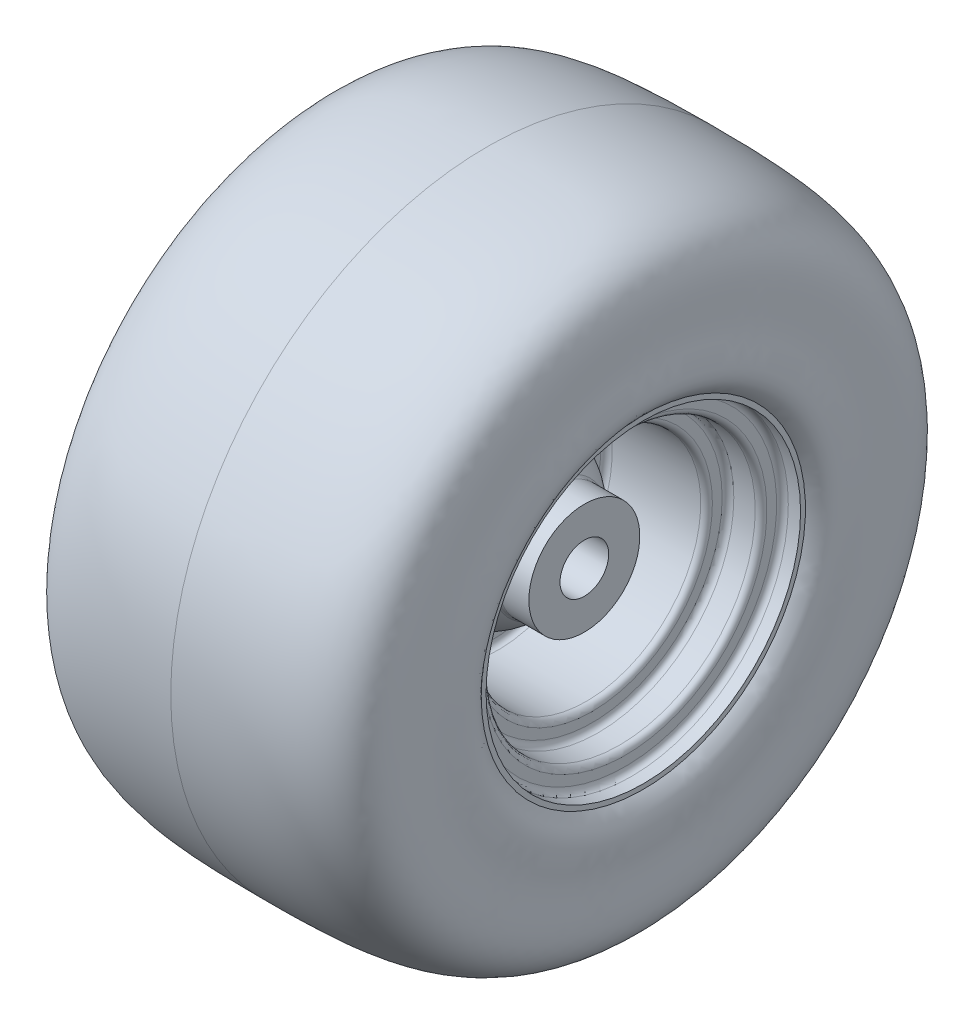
ISO-10303-21;
HEADER;
FILE_DESCRIPTION(('STEP AP214'),'2;1');
FILE_NAME('part.step','',(''),(''),'','','');
FILE_SCHEMA(('AUTOMOTIVE_DESIGN { 1 0 10303 214 1 1 1 1 }'));
ENDSEC;
DATA;
#1=APPLICATION_CONTEXT('core data for automotive mechanical design processes');
#2=APPLICATION_PROTOCOL_DEFINITION('international standard','automotive_design',2000,#1);
#3=PRODUCT_CONTEXT('',#1,'mechanical');
#4=PRODUCT('Part','Part','',(#3));
#5=PRODUCT_RELATED_PRODUCT_CATEGORY('part','',(#4));
#6=PRODUCT_DEFINITION_FORMATION('','',#4);
#7=PRODUCT_DEFINITION_CONTEXT('part definition',#1,'design');
#8=PRODUCT_DEFINITION('design','',#6,#7);
#9=PRODUCT_DEFINITION_SHAPE('','',#8);
#10=(LENGTH_UNIT() NAMED_UNIT(*) SI_UNIT(.MILLI.,.METRE.));
#11=(NAMED_UNIT(*) PLANE_ANGLE_UNIT() SI_UNIT($,.RADIAN.));
#12=(NAMED_UNIT(*) SI_UNIT($,.STERADIAN.) SOLID_ANGLE_UNIT());
#13=UNCERTAINTY_MEASURE_WITH_UNIT(LENGTH_MEASURE(1.E-05),#10,'distance_accuracy_value','');
#14=(GEOMETRIC_REPRESENTATION_CONTEXT(3) GLOBAL_UNCERTAINTY_ASSIGNED_CONTEXT((#13)) GLOBAL_UNIT_ASSIGNED_CONTEXT((#10,
#11,#12)) REPRESENTATION_CONTEXT('',''));
#15=CARTESIAN_POINT('',(0.,0.,0.));
#16=DIRECTION('',(0.,0.,1.));
#17=DIRECTION('',(1.,0.,0.));
#18=AXIS2_PLACEMENT_3D('',#15,#16,#17);
#19=CARTESIAN_POINT('',(-43.3521576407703,0.,0.));
#20=DIRECTION('',(-1.,0.,0.));
#21=DIRECTION('',(0.,0.,1.));
#22=AXIS2_PLACEMENT_3D('',#19,#20,#21);
#23=CYLINDRICAL_SURFACE('',#22,28.5);
#24=CARTESIAN_POINT('',(-50.,0.,0.));
#25=DIRECTION('',(-1.,0.,0.));
#26=DIRECTION('',(0.,0.,1.));
#27=AXIS2_PLACEMENT_3D('',#24,#25,#26);
#28=CIRCLE('',#27,28.5);
#29=CARTESIAN_POINT('',(-50.,0.,28.5));
#30=VERTEX_POINT('',#29);
#31=EDGE_CURVE('E10',#30,#30,#28,.T.);
#32=ORIENTED_EDGE('',*,*,#31,.F.);
#33=EDGE_LOOP('',(#32));
#34=FACE_BOUND('',#33,.T.);
#35=CARTESIAN_POINT('',(-34.3795027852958,0.,0.));
#36=DIRECTION('',(-1.,0.,0.));
#37=DIRECTION('',(0.,0.,1.));
#38=AXIS2_PLACEMENT_3D('',#35,#36,#37);
#39=CIRCLE('',#38,28.5);
#40=CARTESIAN_POINT('',(-34.3795027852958,0.,28.5));
#41=VERTEX_POINT('',#40);
#42=EDGE_CURVE('E144',#41,#41,#39,.T.);
#43=ORIENTED_EDGE('',*,*,#42,.T.);
#44=EDGE_LOOP('',(#43));
#45=FACE_BOUND('',#44,.T.);
#46=ADVANCED_FACE('F29',(#34,#45),#23,.T.);
#47=CARTESIAN_POINT('',(-50.,0.,-28.5));
#48=DIRECTION('',(1.,0.,0.));
#49=DIRECTION('',(0.,0.,-1.));
#50=AXIS2_PLACEMENT_3D('',#47,#48,#49);
#51=PLANE('',#50);
#52=CARTESIAN_POINT('',(-50.,0.,0.));
#53=DIRECTION('',(-1.,0.,0.));
#54=DIRECTION('',(0.,0.,1.));
#55=AXIS2_PLACEMENT_3D('',#52,#53,#54);
#56=CIRCLE('',#55,12.5);
#57=CARTESIAN_POINT('',(-50.,0.,12.5));
#58=VERTEX_POINT('',#57);
#59=EDGE_CURVE('E35',#58,#58,#56,.T.);
#60=ORIENTED_EDGE('',*,*,#59,.F.);
#61=EDGE_LOOP('',(#60));
#62=FACE_BOUND('',#61,.T.);
#63=ORIENTED_EDGE('',*,*,#31,.T.);
#64=EDGE_LOOP('',(#63));
#65=FACE_BOUND('',#64,.T.);
#66=ADVANCED_FACE('F239',(#62,#65),#51,.F.);
#67=CARTESIAN_POINT('',(-43.3521576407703,0.,0.));
#68=DIRECTION('',(-1.,0.,0.));
#69=DIRECTION('',(0.,0.,1.));
#70=AXIS2_PLACEMENT_3D('',#67,#68,#69);
#71=CYLINDRICAL_SURFACE('',#70,12.5);
#72=CARTESIAN_POINT('',(50.,0.,0.));
#73=DIRECTION('',(-1.,0.,0.));
#74=DIRECTION('',(0.,0.,1.));
#75=AXIS2_PLACEMENT_3D('',#72,#73,#74);
#76=CIRCLE('',#75,12.5);
#77=CARTESIAN_POINT('',(50.,0.,12.5));
#78=VERTEX_POINT('',#77);
#79=EDGE_CURVE('E39',#78,#78,#76,.T.);
#80=ORIENTED_EDGE('',*,*,#79,.F.);
#81=EDGE_LOOP('',(#80));
#82=FACE_BOUND('',#81,.T.);
#83=ORIENTED_EDGE('',*,*,#59,.T.);
#84=EDGE_LOOP('',(#83));
#85=FACE_BOUND('',#84,.T.);
#86=ADVANCED_FACE('F236',(#82,#85),#71,.F.);
#87=CARTESIAN_POINT('',(50.,0.,-28.5));
#88=DIRECTION('',(-1.,0.,0.));
#89=DIRECTION('',(0.,0.,1.));
#90=AXIS2_PLACEMENT_3D('',#87,#88,#89);
#91=PLANE('',#90);
#92=CARTESIAN_POINT('',(50.,0.,0.));
#93=DIRECTION('',(-1.,0.,0.));
#94=DIRECTION('',(0.,0.,1.));
#95=AXIS2_PLACEMENT_3D('',#92,#93,#94);
#96=CIRCLE('',#95,28.5);
#97=CARTESIAN_POINT('',(50.,0.,28.5));
#98=VERTEX_POINT('',#97);
#99=EDGE_CURVE('E43',#98,#98,#96,.T.);
#100=ORIENTED_EDGE('',*,*,#99,.F.);
#101=EDGE_LOOP('',(#100));
#102=FACE_BOUND('',#101,.T.);
#103=ORIENTED_EDGE('',*,*,#79,.T.);
#104=EDGE_LOOP('',(#103));
#105=FACE_BOUND('',#104,.T.);
#106=ADVANCED_FACE('F232',(#102,#105),#91,.F.);
#107=CARTESIAN_POINT('',(-43.3521576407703,0.,0.));
#108=DIRECTION('',(-1.,0.,0.));
#109=DIRECTION('',(0.,0.,1.));
#110=AXIS2_PLACEMENT_3D('',#107,#108,#109);
#111=CYLINDRICAL_SURFACE('',#110,28.5);
#112=CARTESIAN_POINT('',(34.3795027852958,0.,0.));
#113=DIRECTION('',(-1.,0.,0.));
#114=DIRECTION('',(0.,0.,1.));
#115=AXIS2_PLACEMENT_3D('',#112,#113,#114);
#116=CIRCLE('',#115,28.5);
#117=CARTESIAN_POINT('',(34.3795027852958,0.,28.5));
#118=VERTEX_POINT('',#117);
#119=EDGE_CURVE('E48',#118,#118,#116,.T.);
#120=ORIENTED_EDGE('',*,*,#119,.F.);
#121=EDGE_LOOP('',(#120));
#122=FACE_BOUND('',#121,.T.);
#123=ORIENTED_EDGE('',*,*,#99,.T.);
#124=EDGE_LOOP('',(#123));
#125=FACE_BOUND('',#124,.T.);
#126=ADVANCED_FACE('F228',(#122,#125),#111,.T.);
#127=CARTESIAN_POINT('',(34.3795027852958,0.,0.));
#128=DIRECTION('',(-1.,0.,0.));
#129=DIRECTION('',(0.,0.,1.));
#130=AXIS2_PLACEMENT_3D('',#127,#128,#129);
#131=TOROIDAL_SURFACE('',#130,31.5,3.00000000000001);
#132=CARTESIAN_POINT('',(32.2367100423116,0.,0.));
#133=DIRECTION('',(-1.,0.,0.));
#134=DIRECTION('',(0.,0.,1.));
#135=AXIS2_PLACEMENT_3D('',#132,#133,#134);
#136=CIRCLE('',#135,29.4003716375);
#137=CARTESIAN_POINT('',(32.2367100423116,0.,29.4003716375));
#138=VERTEX_POINT('',#137);
#139=EDGE_CURVE('E51',#138,#138,#136,.T.);
#140=ORIENTED_EDGE('',*,*,#139,.F.);
#141=EDGE_LOOP('',(#140));
#142=FACE_BOUND('',#141,.T.);
#143=ORIENTED_EDGE('',*,*,#119,.T.);
#144=EDGE_LOOP('',(#143));
#145=FACE_BOUND('',#144,.T.);
#146=ADVANCED_FACE('F224',(#142,#145),#131,.F.);
#147=CARTESIAN_POINT('',(-6.76211788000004,0.,0.));
#148=DIRECTION('',(-1.,0.,0.));
#149=DIRECTION('',(0.,0.,1.));
#150=AXIS2_PLACEMENT_3D('',#147,#148,#149);
#151=DEGENERATE_TOROIDAL_SURFACE('',#150,8.81286456,54.6,.F.);
#152=CARTESIAN_POINT('',(4.86134802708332,0.,0.));
#153=DIRECTION('',(-1.,0.,0.));
#154=DIRECTION('',(0.,0.,1.));
#155=AXIS2_PLACEMENT_3D('',#152,#153,#154);
#156=CIRCLE('',#155,44.5355659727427);
#157=CARTESIAN_POINT('',(4.86134802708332,0.,44.5355659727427));
#158=VERTEX_POINT('',#157);
#159=EDGE_CURVE('E54',#158,#158,#156,.T.);
#160=ORIENTED_EDGE('',*,*,#159,.F.);
#161=EDGE_LOOP('',(#160));
#162=FACE_BOUND('',#161,.T.);
#163=ORIENTED_EDGE('',*,*,#139,.T.);
#164=EDGE_LOOP('',(#163));
#165=FACE_BOUND('',#164,.T.);
#166=ADVANCED_FACE('F220',(#162,#165),#151,.F.);
#167=CARTESIAN_POINT('',(5.49999999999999,0.,0.));
#168=DIRECTION('',(-1.,0.,0.));
#169=DIRECTION('',(0.,0.,1.));
#170=AXIS2_PLACEMENT_3D('',#167,#168,#169);
#171=TOROIDAL_SURFACE('',#170,47.4667984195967,3.00000000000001);
#172=CARTESIAN_POINT('',(2.49999999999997,0.,0.));
#173=DIRECTION('',(-1.,0.,0.));
#174=DIRECTION('',(0.,0.,1.));
#175=AXIS2_PLACEMENT_3D('',#172,#173,#174);
#176=CIRCLE('',#175,47.4667984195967);
#177=CARTESIAN_POINT('',(2.49999999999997,0.,47.4667984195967));
#178=VERTEX_POINT('',#177);
#179=EDGE_CURVE('E57',#178,#178,#176,.T.);
#180=ORIENTED_EDGE('',*,*,#179,.F.);
#181=EDGE_LOOP('',(#180));
#182=FACE_BOUND('',#181,.T.);
#183=ORIENTED_EDGE('',*,*,#159,.T.);
#184=EDGE_LOOP('',(#183));
#185=FACE_BOUND('',#184,.T.);
#186=ADVANCED_FACE('F216',(#182,#185),#171,.F.);
#187=CARTESIAN_POINT('',(2.49999999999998,0.,-47.4667984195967));
#188=DIRECTION('',(-1.,0.,0.));
#189=DIRECTION('',(0.,0.,1.));
#190=AXIS2_PLACEMENT_3D('',#187,#188,#189);
#191=PLANE('',#190);
#192=CARTESIAN_POINT('',(2.49999999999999,0.,0.));
#193=DIRECTION('',(-1.,0.,0.));
#194=DIRECTION('',(0.,0.,1.));
#195=AXIS2_PLACEMENT_3D('',#192,#193,#194);
#196=CIRCLE('',#195,55.8);
#197=CARTESIAN_POINT('',(2.49999999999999,0.,55.8));
#198=VERTEX_POINT('',#197);
#199=EDGE_CURVE('E60',#198,#198,#196,.T.);
#200=ORIENTED_EDGE('',*,*,#199,.F.);
#201=EDGE_LOOP('',(#200));
#202=FACE_BOUND('',#201,.T.);
#203=ORIENTED_EDGE('',*,*,#179,.T.);
#204=EDGE_LOOP('',(#203));
#205=FACE_BOUND('',#204,.T.);
#206=ADVANCED_FACE('F212',(#202,#205),#191,.F.);
#207=CARTESIAN_POINT('',(5.49999999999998,0.,0.));
#208=DIRECTION('',(-1.,0.,0.));
#209=DIRECTION('',(0.,0.,1.));
#210=AXIS2_PLACEMENT_3D('',#207,#208,#209);
#211=TOROIDAL_SURFACE('',#210,55.8,3.);
#212=CARTESIAN_POINT('',(5.50000000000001,0.,0.));
#213=DIRECTION('',(-1.,0.,0.));
#214=DIRECTION('',(0.,0.,1.));
#215=AXIS2_PLACEMENT_3D('',#212,#213,#214);
#216=CIRCLE('',#215,58.8);
#217=CARTESIAN_POINT('',(5.50000000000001,0.,58.8));
#218=VERTEX_POINT('',#217);
#219=EDGE_CURVE('E63',#218,#218,#216,.T.);
#220=ORIENTED_EDGE('',*,*,#219,.F.);
#221=EDGE_LOOP('',(#220));
#222=FACE_BOUND('',#221,.T.);
#223=ORIENTED_EDGE('',*,*,#199,.T.);
#224=EDGE_LOOP('',(#223));
#225=FACE_BOUND('',#224,.T.);
#226=ADVANCED_FACE('F208',(#222,#225),#211,.F.);
#227=CARTESIAN_POINT('',(-43.3521576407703,0.,0.));
#228=DIRECTION('',(-1.,0.,0.));
#229=DIRECTION('',(0.,0.,1.));
#230=AXIS2_PLACEMENT_3D('',#227,#228,#229);
#231=CYLINDRICAL_SURFACE('',#230,58.8);
#232=CARTESIAN_POINT('',(51.,0.,0.));
#233=DIRECTION('',(-1.,0.,0.));
#234=DIRECTION('',(0.,0.,1.));
#235=AXIS2_PLACEMENT_3D('',#232,#233,#234);
#236=CIRCLE('',#235,58.8);
#237=CARTESIAN_POINT('',(51.,0.,58.8));
#238=VERTEX_POINT('',#237);
#239=EDGE_CURVE('E66',#238,#238,#236,.T.);
#240=ORIENTED_EDGE('',*,*,#239,.F.);
#241=EDGE_LOOP('',(#240));
#242=FACE_BOUND('',#241,.T.);
#243=ORIENTED_EDGE('',*,*,#219,.T.);
#244=EDGE_LOOP('',(#243));
#245=FACE_BOUND('',#244,.T.);
#246=ADVANCED_FACE('F204',(#242,#245),#231,.F.);
#247=CARTESIAN_POINT('',(51.,0.,0.));
#248=DIRECTION('',(-1.,0.,0.));
#249=DIRECTION('',(0.,0.,1.));
#250=AXIS2_PLACEMENT_3D('',#247,#248,#249);
#251=TOROIDAL_SURFACE('',#250,61.8,3.);
#252=CARTESIAN_POINT('',(54.,0.,0.));
#253=DIRECTION('',(-1.,0.,0.));
#254=DIRECTION('',(0.,0.,1.));
#255=AXIS2_PLACEMENT_3D('',#252,#253,#254);
#256=CIRCLE('',#255,61.8);
#257=CARTESIAN_POINT('',(54.,0.,61.8));
#258=VERTEX_POINT('',#257);
#259=EDGE_CURVE('E69',#258,#258,#256,.T.);
#260=ORIENTED_EDGE('',*,*,#259,.F.);
#261=EDGE_LOOP('',(#260));
#262=FACE_BOUND('',#261,.T.);
#263=ORIENTED_EDGE('',*,*,#239,.T.);
#264=EDGE_LOOP('',(#263));
#265=FACE_BOUND('',#264,.T.);
#266=ADVANCED_FACE('F200',(#262,#265),#251,.T.);
#267=CARTESIAN_POINT('',(54.,0.,-61.8));
#268=DIRECTION('',(-1.,0.,0.));
#269=DIRECTION('',(0.,0.,1.));
#270=AXIS2_PLACEMENT_3D('',#267,#268,#269);
#271=PLANE('',#270);
#272=CARTESIAN_POINT('',(54.,0.,0.));
#273=DIRECTION('',(-1.,0.,0.));
#274=DIRECTION('',(0.,0.,1.));
#275=AXIS2_PLACEMENT_3D('',#272,#273,#274);
#276=CIRCLE('',#275,66.8);
#277=CARTESIAN_POINT('',(54.,0.,66.8));
#278=VERTEX_POINT('',#277);
#279=EDGE_CURVE('E72',#278,#278,#276,.T.);
#280=ORIENTED_EDGE('',*,*,#279,.F.);
#281=EDGE_LOOP('',(#280));
#282=FACE_BOUND('',#281,.T.);
#283=ORIENTED_EDGE('',*,*,#259,.T.);
#284=EDGE_LOOP('',(#283));
#285=FACE_BOUND('',#284,.T.);
#286=ADVANCED_FACE('F196',(#282,#285),#271,.F.);
#287=CARTESIAN_POINT('',(57.,0.,0.));
#288=DIRECTION('',(-1.,0.,0.));
#289=DIRECTION('',(0.,0.,1.));
#290=AXIS2_PLACEMENT_3D('',#287,#288,#289);
#291=TOROIDAL_SURFACE('',#290,66.8,3.);
#292=CARTESIAN_POINT('',(57.,0.,0.));
#293=DIRECTION('',(-1.,0.,0.));
#294=DIRECTION('',(0.,0.,1.));
#295=AXIS2_PLACEMENT_3D('',#292,#293,#294);
#296=CIRCLE('',#295,69.8);
#297=CARTESIAN_POINT('',(57.,0.,69.8));
#298=VERTEX_POINT('',#297);
#299=EDGE_CURVE('E75',#298,#298,#296,.T.);
#300=ORIENTED_EDGE('',*,*,#299,.F.);
#301=EDGE_LOOP('',(#300));
#302=FACE_BOUND('',#301,.T.);
#303=ORIENTED_EDGE('',*,*,#279,.T.);
#304=EDGE_LOOP('',(#303));
#305=FACE_BOUND('',#304,.T.);
#306=ADVANCED_FACE('F192',(#302,#305),#291,.F.);
#307=CARTESIAN_POINT('',(-43.3521576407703,0.,0.));
#308=DIRECTION('',(-1.,0.,0.));
#309=DIRECTION('',(0.,0.,1.));
#310=AXIS2_PLACEMENT_3D('',#307,#308,#309);
#311=CYLINDRICAL_SURFACE('',#310,69.8);
#312=CARTESIAN_POINT('',(68.,0.,0.));
#313=DIRECTION('',(-1.,0.,0.));
#314=DIRECTION('',(0.,0.,1.));
#315=AXIS2_PLACEMENT_3D('',#312,#313,#314);
#316=CIRCLE('',#315,69.8);
#317=CARTESIAN_POINT('',(68.,0.,69.8));
#318=VERTEX_POINT('',#317);
#319=EDGE_CURVE('E78',#318,#318,#316,.T.);
#320=ORIENTED_EDGE('',*,*,#319,.F.);
#321=EDGE_LOOP('',(#320));
#322=FACE_BOUND('',#321,.T.);
#323=ORIENTED_EDGE('',*,*,#299,.T.);
#324=EDGE_LOOP('',(#323));
#325=FACE_BOUND('',#324,.T.);
#326=ADVANCED_FACE('F188',(#322,#325),#311,.F.);
#327=CARTESIAN_POINT('',(68.,0.,0.));
#328=DIRECTION('',(-1.,0.,0.));
#329=DIRECTION('',(0.,0.,1.));
#330=AXIS2_PLACEMENT_3D('',#327,#328,#329);
#331=TOROIDAL_SURFACE('',#330,72.8,3.);
#332=CARTESIAN_POINT('',(71.,0.,0.));
#333=DIRECTION('',(-1.,0.,0.));
#334=DIRECTION('',(0.,0.,1.));
#335=AXIS2_PLACEMENT_3D('',#332,#333,#334);
#336=CIRCLE('',#335,72.8);
#337=CARTESIAN_POINT('',(71.,0.,72.8));
#338=VERTEX_POINT('',#337);
#339=EDGE_CURVE('E81',#338,#338,#336,.T.);
#340=ORIENTED_EDGE('',*,*,#339,.F.);
#341=EDGE_LOOP('',(#340));
#342=FACE_BOUND('',#341,.T.);
#343=ORIENTED_EDGE('',*,*,#319,.T.);
#344=EDGE_LOOP('',(#343));
#345=FACE_BOUND('',#344,.T.);
#346=ADVANCED_FACE('F184',(#342,#345),#331,.T.);
#347=CARTESIAN_POINT('',(71.,0.,-72.8));
#348=DIRECTION('',(-1.,0.,0.));
#349=DIRECTION('',(0.,0.,1.));
#350=AXIS2_PLACEMENT_3D('',#347,#348,#349);
#351=PLANE('',#350);
#352=CARTESIAN_POINT('',(71.,0.,0.));
#353=DIRECTION('',(-1.,0.,0.));
#354=DIRECTION('',(0.,0.,1.));
#355=AXIS2_PLACEMENT_3D('',#352,#353,#354);
#356=CIRCLE('',#355,77.8);
#357=CARTESIAN_POINT('',(71.,0.,77.8));
#358=VERTEX_POINT('',#357);
#359=EDGE_CURVE('E84',#358,#358,#356,.T.);
#360=ORIENTED_EDGE('',*,*,#359,.F.);
#361=EDGE_LOOP('',(#360));
#362=FACE_BOUND('',#361,.T.);
#363=ORIENTED_EDGE('',*,*,#339,.T.);
#364=EDGE_LOOP('',(#363));
#365=FACE_BOUND('',#364,.T.);
#366=ADVANCED_FACE('F180',(#362,#365),#351,.F.);
#367=CARTESIAN_POINT('',(74.,0.,0.));
#368=DIRECTION('',(-1.,0.,0.));
#369=DIRECTION('',(0.,0.,1.));
#370=AXIS2_PLACEMENT_3D('',#367,#368,#369);
#371=TOROIDAL_SURFACE('',#370,77.8,3.);
#372=CARTESIAN_POINT('',(74.,0.,0.));
#373=DIRECTION('',(-1.,0.,0.));
#374=DIRECTION('',(0.,0.,1.));
#375=AXIS2_PLACEMENT_3D('',#372,#373,#374);
#376=CIRCLE('',#375,80.8);
#377=CARTESIAN_POINT('',(74.,0.,80.8));
#378=VERTEX_POINT('',#377);
#379=EDGE_CURVE('E87',#378,#378,#376,.T.);
#380=ORIENTED_EDGE('',*,*,#379,.F.);
#381=EDGE_LOOP('',(#380));
#382=FACE_BOUND('',#381,.T.);
#383=ORIENTED_EDGE('',*,*,#359,.T.);
#384=EDGE_LOOP('',(#383));
#385=FACE_BOUND('',#384,.T.);
#386=ADVANCED_FACE('F176',(#382,#385),#371,.F.);
#387=CARTESIAN_POINT('',(-43.3521576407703,0.,0.));
#388=DIRECTION('',(-1.,0.,0.));
#389=DIRECTION('',(0.,0.,1.));
#390=AXIS2_PLACEMENT_3D('',#387,#388,#389);
#391=CYLINDRICAL_SURFACE('',#390,80.8);
#392=CARTESIAN_POINT('',(80.3,0.,0.));
#393=DIRECTION('',(-1.,0.,0.));
#394=DIRECTION('',(0.,0.,1.));
#395=AXIS2_PLACEMENT_3D('',#392,#393,#394);
#396=CIRCLE('',#395,80.8);
#397=CARTESIAN_POINT('',(80.3,0.,80.8));
#398=VERTEX_POINT('',#397);
#399=EDGE_CURVE('E90',#398,#398,#396,.T.);
#400=ORIENTED_EDGE('',*,*,#399,.F.);
#401=EDGE_LOOP('',(#400));
#402=FACE_BOUND('',#401,.T.);
#403=ORIENTED_EDGE('',*,*,#379,.T.);
#404=EDGE_LOOP('',(#403));
#405=FACE_BOUND('',#404,.T.);
#406=ADVANCED_FACE('F172',(#402,#405),#391,.F.);
#407=CARTESIAN_POINT('',(80.3,0.,-80.8));
#408=DIRECTION('',(-1.,0.,0.));
#409=DIRECTION('',(0.,0.,1.));
#410=AXIS2_PLACEMENT_3D('',#407,#408,#409);
#411=PLANE('',#410);
#412=CARTESIAN_POINT('',(80.3,0.,0.));
#413=DIRECTION('',(-1.,0.,0.));
#414=DIRECTION('',(0.,0.,1.));
#415=AXIS2_PLACEMENT_3D('',#412,#413,#414);
#416=CIRCLE('',#415,83.3);
#417=CARTESIAN_POINT('',(80.3,0.,83.3));
#418=VERTEX_POINT('',#417);
#419=EDGE_CURVE('E93',#418,#418,#416,.T.);
#420=ORIENTED_EDGE('',*,*,#419,.F.);
#421=EDGE_LOOP('',(#420));
#422=FACE_BOUND('',#421,.T.);
#423=ORIENTED_EDGE('',*,*,#399,.T.);
#424=EDGE_LOOP('',(#423));
#425=FACE_BOUND('',#424,.T.);
#426=ADVANCED_FACE('F168',(#422,#425),#411,.F.);
#427=CARTESIAN_POINT('',(80.3,0.,-83.3));
#428=CARTESIAN_POINT('',(81.7916587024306,0.,-84.7461554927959));
#429=CARTESIAN_POINT('',(88.0411820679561,0.,-90.8050364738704));
#430=CARTESIAN_POINT('',(82.3574435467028,0.,-111.706032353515));
#431=CARTESIAN_POINT('',(90.9745394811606,0.,-162.134058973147));
#432=CARTESIAN_POINT('',(38.3567483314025,0.,-162.345711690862));
#433=CARTESIAN_POINT('',(0.,0.,-162.5));
#434=B_SPLINE_CURVE_WITH_KNOTS('',3,(#427,#428,#429,#430,#431,#432,#433),.UNSPECIFIED.,.F.,.F.,
(4,1,1,1,4),(0.,0.0418672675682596,0.175409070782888,0.398898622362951,1.),.UNSPECIFIED.);
#435=CARTESIAN_POINT('',(-43.3521576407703,0.,0.));
#436=DIRECTION('',(-1.,0.,0.));
#437=AXIS1_PLACEMENT('',#435,#436);
#438=SURFACE_OF_REVOLUTION('',#434,#437);
#439=CARTESIAN_POINT('',(0.,0.,0.));
#440=DIRECTION('',(-1.,0.,0.));
#441=DIRECTION('',(0.,0.,1.));
#442=AXIS2_PLACEMENT_3D('',#439,#440,#441);
#443=CIRCLE('',#442,162.5);
#444=CARTESIAN_POINT('',(0.,0.,162.5));
#445=VERTEX_POINT('',#444);
#446=EDGE_CURVE('E96',#445,#445,#443,.T.);
#447=ORIENTED_EDGE('',*,*,#446,.F.);
#448=EDGE_LOOP('',(#447));
#449=FACE_BOUND('',#448,.T.);
#450=ORIENTED_EDGE('',*,*,#419,.T.);
#451=EDGE_LOOP('',(#450));
#452=FACE_BOUND('',#451,.T.);
#453=ADVANCED_FACE('F163',(#449,#452),#438,.T.);
#454=CARTESIAN_POINT('',(0.,0.,-162.5));
#455=CARTESIAN_POINT('',(-38.3567483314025,0.,-162.345711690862));
#456=CARTESIAN_POINT('',(-90.9745394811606,0.,-162.134058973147));
#457=CARTESIAN_POINT('',(-82.3574435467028,0.,-111.706032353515));
#458=CARTESIAN_POINT('',(-88.041182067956,0.,-90.8050364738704));
#459=CARTESIAN_POINT('',(-81.7916587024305,0.,-84.7461554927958));
#460=CARTESIAN_POINT('',(-80.3,0.,-83.3));
#461=B_SPLINE_CURVE_WITH_KNOTS('',3,(#454,#455,#456,#457,#458,#459,#460),.UNSPECIFIED.,.F.,.F.,
(4,1,1,1,4),(0.,0.601101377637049,0.824590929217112,0.95813273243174,1.),.UNSPECIFIED.);
#462=CARTESIAN_POINT('',(-43.3521576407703,0.,0.));
#463=DIRECTION('',(-1.,0.,0.));
#464=AXIS1_PLACEMENT('',#462,#463);
#465=SURFACE_OF_REVOLUTION('',#461,#464);
#466=CARTESIAN_POINT('',(-80.3,0.,0.));
#467=DIRECTION('',(-1.,0.,0.));
#468=DIRECTION('',(0.,0.,1.));
#469=AXIS2_PLACEMENT_3D('',#466,#467,#468);
#470=CIRCLE('',#469,83.3);
#471=CARTESIAN_POINT('',(-80.3,0.,83.3));
#472=VERTEX_POINT('',#471);
#473=EDGE_CURVE('E99',#472,#472,#470,.T.);
#474=ORIENTED_EDGE('',*,*,#473,.F.);
#475=EDGE_LOOP('',(#474));
#476=FACE_BOUND('',#475,.T.);
#477=ORIENTED_EDGE('',*,*,#446,.T.);
#478=EDGE_LOOP('',(#477));
#479=FACE_BOUND('',#478,.T.);
#480=ADVANCED_FACE('F158',(#476,#479),#465,.T.);
#481=CARTESIAN_POINT('',(-80.3,0.,-80.8));
#482=DIRECTION('',(1.,0.,0.));
#483=DIRECTION('',(0.,0.,-1.));
#484=AXIS2_PLACEMENT_3D('',#481,#482,#483);
#485=PLANE('',#484);
#486=CARTESIAN_POINT('',(-80.3,0.,0.));
#487=DIRECTION('',(-1.,0.,0.));
#488=DIRECTION('',(0.,0.,1.));
#489=AXIS2_PLACEMENT_3D('',#486,#487,#488);
#490=CIRCLE('',#489,80.8);
#491=CARTESIAN_POINT('',(-80.3,0.,80.8));
#492=VERTEX_POINT('',#491);
#493=EDGE_CURVE('E102',#492,#492,#490,.T.);
#494=ORIENTED_EDGE('',*,*,#493,.F.);
#495=EDGE_LOOP('',(#494));
#496=FACE_BOUND('',#495,.T.);
#497=ORIENTED_EDGE('',*,*,#473,.T.);
#498=EDGE_LOOP('',(#497));
#499=FACE_BOUND('',#498,.T.);
#500=ADVANCED_FACE('F162',(#496,#499),#485,.F.);
#501=CARTESIAN_POINT('',(-43.3521576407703,0.,0.));
#502=DIRECTION('',(-1.,0.,0.));
#503=DIRECTION('',(0.,0.,1.));
#504=AXIS2_PLACEMENT_3D('',#501,#502,#503);
#505=CYLINDRICAL_SURFACE('',#504,80.8);
#506=CARTESIAN_POINT('',(-74.,0.,0.));
#507=DIRECTION('',(-1.,0.,0.));
#508=DIRECTION('',(0.,0.,1.));
#509=AXIS2_PLACEMENT_3D('',#506,#507,#508);
#510=CIRCLE('',#509,80.8);
#511=CARTESIAN_POINT('',(-74.,0.,80.8));
#512=VERTEX_POINT('',#511);
#513=EDGE_CURVE('E105',#512,#512,#510,.T.);
#514=ORIENTED_EDGE('',*,*,#513,.F.);
#515=EDGE_LOOP('',(#514));
#516=FACE_BOUND('',#515,.T.);
#517=ORIENTED_EDGE('',*,*,#493,.T.);
#518=EDGE_LOOP('',(#517));
#519=FACE_BOUND('',#518,.T.);
#520=ADVANCED_FACE('F327',(#516,#519),#505,.F.);
#521=CARTESIAN_POINT('',(-74.,0.,0.));
#522=DIRECTION('',(-1.,0.,0.));
#523=DIRECTION('',(0.,0.,1.));
#524=AXIS2_PLACEMENT_3D('',#521,#522,#523);
#525=TOROIDAL_SURFACE('',#524,77.8,3.);
#526=CARTESIAN_POINT('',(-71.,0.,0.));
#527=DIRECTION('',(-1.,0.,0.));
#528=DIRECTION('',(0.,0.,1.));
#529=AXIS2_PLACEMENT_3D('',#526,#527,#528);
#530=CIRCLE('',#529,77.8);
#531=CARTESIAN_POINT('',(-71.,0.,77.8));
#532=VERTEX_POINT('',#531);
#533=EDGE_CURVE('E108',#532,#532,#530,.T.);
#534=ORIENTED_EDGE('',*,*,#533,.F.);
#535=EDGE_LOOP('',(#534));
#536=FACE_BOUND('',#535,.T.);
#537=ORIENTED_EDGE('',*,*,#513,.T.);
#538=EDGE_LOOP('',(#537));
#539=FACE_BOUND('',#538,.T.);
#540=ADVANCED_FACE('F321',(#536,#539),#525,.F.);
#541=CARTESIAN_POINT('',(-71.,0.,-72.8));
#542=DIRECTION('',(1.,0.,0.));
#543=DIRECTION('',(0.,0.,-1.));
#544=AXIS2_PLACEMENT_3D('',#541,#542,#543);
#545=PLANE('',#544);
#546=CARTESIAN_POINT('',(-71.,0.,0.));
#547=DIRECTION('',(-1.,0.,0.));
#548=DIRECTION('',(0.,0.,1.));
#549=AXIS2_PLACEMENT_3D('',#546,#547,#548);
#550=CIRCLE('',#549,72.8);
#551=CARTESIAN_POINT('',(-71.,0.,72.8));
#552=VERTEX_POINT('',#551);
#553=EDGE_CURVE('E111',#552,#552,#550,.T.);
#554=ORIENTED_EDGE('',*,*,#553,.F.);
#555=EDGE_LOOP('',(#554));
#556=FACE_BOUND('',#555,.T.);
#557=ORIENTED_EDGE('',*,*,#533,.T.);
#558=EDGE_LOOP('',(#557));
#559=FACE_BOUND('',#558,.T.);
#560=ADVANCED_FACE('F315',(#556,#559),#545,.F.);
#561=CARTESIAN_POINT('',(-68.,0.,0.));
#562=DIRECTION('',(-1.,0.,0.));
#563=DIRECTION('',(0.,0.,1.));
#564=AXIS2_PLACEMENT_3D('',#561,#562,#563);
#565=TOROIDAL_SURFACE('',#564,72.8,3.);
#566=CARTESIAN_POINT('',(-68.,0.,0.));
#567=DIRECTION('',(-1.,0.,0.));
#568=DIRECTION('',(0.,0.,1.));
#569=AXIS2_PLACEMENT_3D('',#566,#567,#568);
#570=CIRCLE('',#569,69.8);
#571=CARTESIAN_POINT('',(-68.,0.,69.8));
#572=VERTEX_POINT('',#571);
#573=EDGE_CURVE('E114',#572,#572,#570,.T.);
#574=ORIENTED_EDGE('',*,*,#573,.F.);
#575=EDGE_LOOP('',(#574));
#576=FACE_BOUND('',#575,.T.);
#577=ORIENTED_EDGE('',*,*,#553,.T.);
#578=EDGE_LOOP('',(#577));
#579=FACE_BOUND('',#578,.T.);
#580=ADVANCED_FACE('F309',(#576,#579),#565,.T.);
#581=CARTESIAN_POINT('',(-43.3521576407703,0.,0.));
#582=DIRECTION('',(-1.,0.,0.));
#583=DIRECTION('',(0.,0.,1.));
#584=AXIS2_PLACEMENT_3D('',#581,#582,#583);
#585=CYLINDRICAL_SURFACE('',#584,69.8);
#586=CARTESIAN_POINT('',(-57.,0.,0.));
#587=DIRECTION('',(-1.,0.,0.));
#588=DIRECTION('',(0.,0.,1.));
#589=AXIS2_PLACEMENT_3D('',#586,#587,#588);
#590=CIRCLE('',#589,69.8);
#591=CARTESIAN_POINT('',(-57.,0.,69.8));
#592=VERTEX_POINT('',#591);
#593=EDGE_CURVE('E117',#592,#592,#590,.T.);
#594=ORIENTED_EDGE('',*,*,#593,.F.);
#595=EDGE_LOOP('',(#594));
#596=FACE_BOUND('',#595,.T.);
#597=ORIENTED_EDGE('',*,*,#573,.T.);
#598=EDGE_LOOP('',(#597));
#599=FACE_BOUND('',#598,.T.);
#600=ADVANCED_FACE('F303',(#596,#599),#585,.F.);
#601=CARTESIAN_POINT('',(-57.,0.,0.));
#602=DIRECTION('',(-1.,0.,0.));
#603=DIRECTION('',(0.,0.,1.));
#604=AXIS2_PLACEMENT_3D('',#601,#602,#603);
#605=TOROIDAL_SURFACE('',#604,66.8,3.);
#606=CARTESIAN_POINT('',(-54.,0.,0.));
#607=DIRECTION('',(-1.,0.,0.));
#608=DIRECTION('',(0.,0.,1.));
#609=AXIS2_PLACEMENT_3D('',#606,#607,#608);
#610=CIRCLE('',#609,66.8);
#611=CARTESIAN_POINT('',(-54.,0.,66.8));
#612=VERTEX_POINT('',#611);
#613=EDGE_CURVE('E120',#612,#612,#610,.T.);
#614=ORIENTED_EDGE('',*,*,#613,.F.);
#615=EDGE_LOOP('',(#614));
#616=FACE_BOUND('',#615,.T.);
#617=ORIENTED_EDGE('',*,*,#593,.T.);
#618=EDGE_LOOP('',(#617));
#619=FACE_BOUND('',#618,.T.);
#620=ADVANCED_FACE('F297',(#616,#619),#605,.F.);
#621=CARTESIAN_POINT('',(-54.,0.,-61.8));
#622=DIRECTION('',(1.,0.,0.));
#623=DIRECTION('',(0.,0.,-1.));
#624=AXIS2_PLACEMENT_3D('',#621,#622,#623);
#625=PLANE('',#624);
#626=CARTESIAN_POINT('',(-54.,0.,0.));
#627=DIRECTION('',(-1.,0.,0.));
#628=DIRECTION('',(0.,0.,1.));
#629=AXIS2_PLACEMENT_3D('',#626,#627,#628);
#630=CIRCLE('',#629,61.8);
#631=CARTESIAN_POINT('',(-54.,0.,61.8));
#632=VERTEX_POINT('',#631);
#633=EDGE_CURVE('E123',#632,#632,#630,.T.);
#634=ORIENTED_EDGE('',*,*,#633,.F.);
#635=EDGE_LOOP('',(#634));
#636=FACE_BOUND('',#635,.T.);
#637=ORIENTED_EDGE('',*,*,#613,.T.);
#638=EDGE_LOOP('',(#637));
#639=FACE_BOUND('',#638,.T.);
#640=ADVANCED_FACE('F291',(#636,#639),#625,.F.);
#641=CARTESIAN_POINT('',(-51.,0.,0.));
#642=DIRECTION('',(-1.,0.,0.));
#643=DIRECTION('',(0.,0.,1.));
#644=AXIS2_PLACEMENT_3D('',#641,#642,#643);
#645=TOROIDAL_SURFACE('',#644,61.8,3.);
#646=CARTESIAN_POINT('',(-51.,0.,0.));
#647=DIRECTION('',(-1.,0.,0.));
#648=DIRECTION('',(0.,0.,1.));
#649=AXIS2_PLACEMENT_3D('',#646,#647,#648);
#650=CIRCLE('',#649,58.8);
#651=CARTESIAN_POINT('',(-51.,0.,58.8));
#652=VERTEX_POINT('',#651);
#653=EDGE_CURVE('E126',#652,#652,#650,.T.);
#654=ORIENTED_EDGE('',*,*,#653,.F.);
#655=EDGE_LOOP('',(#654));
#656=FACE_BOUND('',#655,.T.);
#657=ORIENTED_EDGE('',*,*,#633,.T.);
#658=EDGE_LOOP('',(#657));
#659=FACE_BOUND('',#658,.T.);
#660=ADVANCED_FACE('F285',(#656,#659),#645,.T.);
#661=CARTESIAN_POINT('',(-43.3521576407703,0.,0.));
#662=DIRECTION('',(-1.,0.,0.));
#663=DIRECTION('',(0.,0.,1.));
#664=AXIS2_PLACEMENT_3D('',#661,#662,#663);
#665=CYLINDRICAL_SURFACE('',#664,58.8);
#666=CARTESIAN_POINT('',(-5.50000000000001,0.,0.));
#667=DIRECTION('',(-1.,0.,0.));
#668=DIRECTION('',(0.,0.,1.));
#669=AXIS2_PLACEMENT_3D('',#666,#667,#668);
#670=CIRCLE('',#669,58.8);
#671=CARTESIAN_POINT('',(-5.50000000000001,0.,58.8));
#672=VERTEX_POINT('',#671);
#673=EDGE_CURVE('E129',#672,#672,#670,.T.);
#674=ORIENTED_EDGE('',*,*,#673,.F.);
#675=EDGE_LOOP('',(#674));
#676=FACE_BOUND('',#675,.T.);
#677=ORIENTED_EDGE('',*,*,#653,.T.);
#678=EDGE_LOOP('',(#677));
#679=FACE_BOUND('',#678,.T.);
#680=ADVANCED_FACE('F279',(#676,#679),#665,.F.);
#681=CARTESIAN_POINT('',(-5.49999999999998,0.,0.));
#682=DIRECTION('',(-1.,0.,0.));
#683=DIRECTION('',(0.,0.,1.));
#684=AXIS2_PLACEMENT_3D('',#681,#682,#683);
#685=TOROIDAL_SURFACE('',#684,55.8,3.);
#686=CARTESIAN_POINT('',(-2.49999999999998,0.,0.));
#687=DIRECTION('',(-1.,0.,0.));
#688=DIRECTION('',(0.,0.,1.));
#689=AXIS2_PLACEMENT_3D('',#686,#687,#688);
#690=CIRCLE('',#689,55.8);
#691=CARTESIAN_POINT('',(-2.49999999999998,0.,55.8));
#692=VERTEX_POINT('',#691);
#693=EDGE_CURVE('E132',#692,#692,#690,.T.);
#694=ORIENTED_EDGE('',*,*,#693,.F.);
#695=EDGE_LOOP('',(#694));
#696=FACE_BOUND('',#695,.T.);
#697=ORIENTED_EDGE('',*,*,#673,.T.);
#698=EDGE_LOOP('',(#697));
#699=FACE_BOUND('',#698,.T.);
#700=ADVANCED_FACE('F273',(#696,#699),#685,.F.);
#701=CARTESIAN_POINT('',(-2.49999999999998,0.,-47.4667984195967));
#702=DIRECTION('',(1.,0.,0.));
#703=DIRECTION('',(0.,0.,-1.));
#704=AXIS2_PLACEMENT_3D('',#701,#702,#703);
#705=PLANE('',#704);
#706=CARTESIAN_POINT('',(-2.49999999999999,0.,0.));
#707=DIRECTION('',(-1.,0.,0.));
#708=DIRECTION('',(0.,0.,1.));
#709=AXIS2_PLACEMENT_3D('',#706,#707,#708);
#710=CIRCLE('',#709,47.4667984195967);
#711=CARTESIAN_POINT('',(-2.49999999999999,0.,47.4667984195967));
#712=VERTEX_POINT('',#711);
#713=EDGE_CURVE('E135',#712,#712,#710,.T.);
#714=ORIENTED_EDGE('',*,*,#713,.F.);
#715=EDGE_LOOP('',(#714));
#716=FACE_BOUND('',#715,.T.);
#717=ORIENTED_EDGE('',*,*,#693,.T.);
#718=EDGE_LOOP('',(#717));
#719=FACE_BOUND('',#718,.T.);
#720=ADVANCED_FACE('F267',(#716,#719),#705,.F.);
#721=CARTESIAN_POINT('',(-5.49999999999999,0.,0.));
#722=DIRECTION('',(-1.,0.,0.));
#723=DIRECTION('',(0.,0.,1.));
#724=AXIS2_PLACEMENT_3D('',#721,#722,#723);
#725=TOROIDAL_SURFACE('',#724,47.4667984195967,3.00000000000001);
#726=CARTESIAN_POINT('',(-4.86134802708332,0.,0.));
#727=DIRECTION('',(-1.,0.,0.));
#728=DIRECTION('',(0.,0.,1.));
#729=AXIS2_PLACEMENT_3D('',#726,#727,#728);
#730=CIRCLE('',#729,44.5355659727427);
#731=CARTESIAN_POINT('',(-4.86134802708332,0.,44.5355659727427));
#732=VERTEX_POINT('',#731);
#733=EDGE_CURVE('E138',#732,#732,#730,.T.);
#734=ORIENTED_EDGE('',*,*,#733,.F.);
#735=EDGE_LOOP('',(#734));
#736=FACE_BOUND('',#735,.T.);
#737=ORIENTED_EDGE('',*,*,#713,.T.);
#738=EDGE_LOOP('',(#737));
#739=FACE_BOUND('',#738,.T.);
#740=ADVANCED_FACE('F261',(#736,#739),#725,.F.);
#741=CARTESIAN_POINT('',(6.76211788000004,0.,0.));
#742=DIRECTION('',(-1.,0.,0.));
#743=DIRECTION('',(0.,0.,1.));
#744=AXIS2_PLACEMENT_3D('',#741,#742,#743);
#745=DEGENERATE_TOROIDAL_SURFACE('',#744,8.81286456,54.6,.F.);
#746=CARTESIAN_POINT('',(-32.2367100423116,0.,0.));
#747=DIRECTION('',(-1.,0.,0.));
#748=DIRECTION('',(0.,0.,1.));
#749=AXIS2_PLACEMENT_3D('',#746,#747,#748);
#750=CIRCLE('',#749,29.4003716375);
#751=CARTESIAN_POINT('',(-32.2367100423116,0.,29.4003716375));
#752=VERTEX_POINT('',#751);
#753=EDGE_CURVE('E141',#752,#752,#750,.T.);
#754=ORIENTED_EDGE('',*,*,#753,.F.);
#755=EDGE_LOOP('',(#754));
#756=FACE_BOUND('',#755,.T.);
#757=ORIENTED_EDGE('',*,*,#733,.T.);
#758=EDGE_LOOP('',(#757));
#759=FACE_BOUND('',#758,.T.);
#760=ADVANCED_FACE('F255',(#756,#759),#745,.F.);
#761=CARTESIAN_POINT('',(-34.3795027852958,0.,0.));
#762=DIRECTION('',(-1.,0.,0.));
#763=DIRECTION('',(0.,0.,1.));
#764=AXIS2_PLACEMENT_3D('',#761,#762,#763);
#765=TOROIDAL_SURFACE('',#764,31.5,3.00000000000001);
#766=ORIENTED_EDGE('',*,*,#42,.F.);
#767=EDGE_LOOP('',(#766));
#768=FACE_BOUND('',#767,.T.);
#769=ORIENTED_EDGE('',*,*,#753,.T.);
#770=EDGE_LOOP('',(#769));
#771=FACE_BOUND('',#770,.T.);
#772=ADVANCED_FACE('F252',(#768,#771),#765,.F.);
#773=CLOSED_SHELL('',(#46,#66,#86,#106,#126,#146,#166,#186,#206,#226,#246,#266,#286,#306,#326,
#346,#366,#386,#406,#426,#453,#480,#500,#520,#540,#560,#580,#600,#620,#640,#660,#680,#700,#720,
#740,#760,#772));
#774=MANIFOLD_SOLID_BREP('B2',#773);
#775=ADVANCED_BREP_SHAPE_REPRESENTATION('',(#18,#774),#14);
#776=SHAPE_DEFINITION_REPRESENTATION(#9,#775);
ENDSEC;
END-ISO-10303-21;
